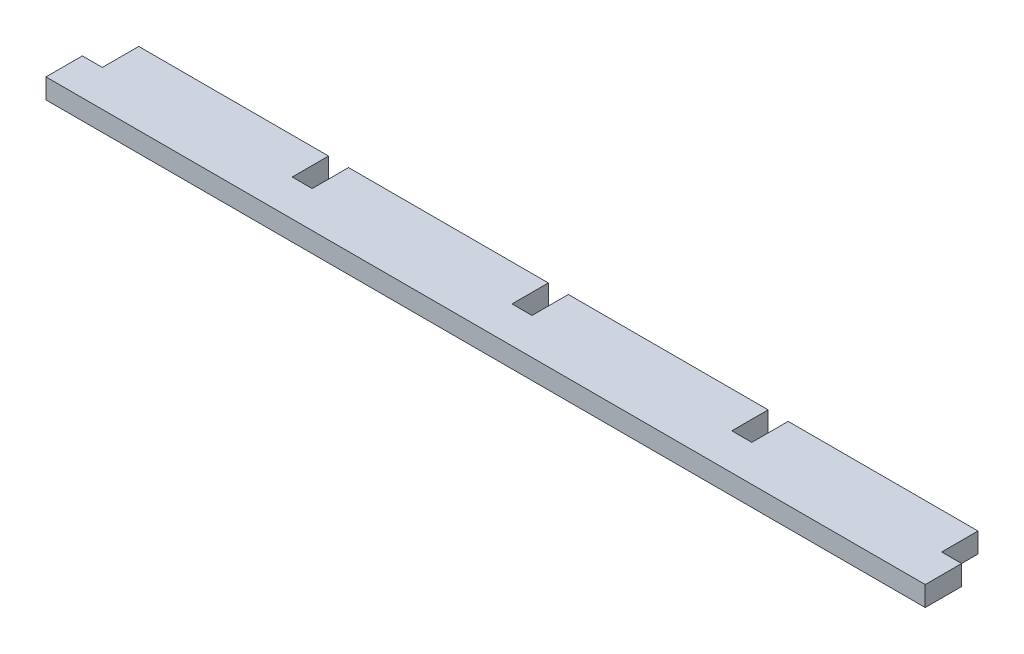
from build123d import *

# Parameters (mm, degrees)
BOSS_EXTRUDE1_DEPTH = 6.35


with BuildPart() as part:
    # Sketch1 → Boss-Extrude1 (new body)
    with BuildSketch(Plane(origin=(0, 0, 0), x_dir=(1, 0, 0), z_dir=(0, 1, 0))):
        Polygon((-279.4, 0), (0, 0), (0, 11.557), (-6.35, 11.557), (-6.35, 23.114), (-66.675, 23.114), (-66.675, 11.557), (-73.025, 11.557), (-73.025, 23.114), (-136.525, 23.114), (-136.525, 11.557), (-142.875, 11.557), (-142.875, 23.114), (-206.375, 23.114), (-206.375, 11.557), (-212.725, 11.557), (-212.725, 23.114), (-273.05, 23.114), (-273.05, 11.557), (-279.4, 11.557), align=None)
    extrude(amount=BOSS_EXTRUDE1_DEPTH)


solid = part.part
